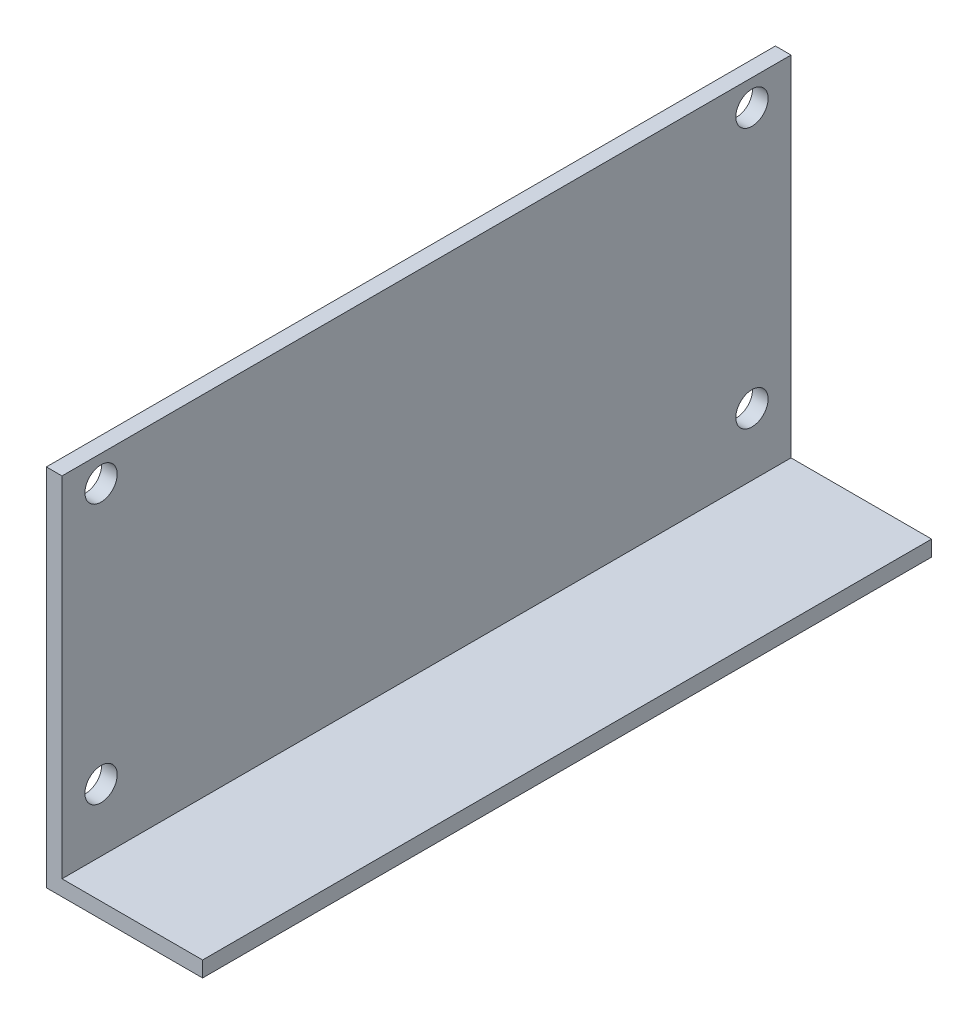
from build123d import *

# Parameters (mm, degrees)
BASE_EXTRUSION_DEPTH    = 70
ESQUISSE2_R             = 3.1
ENL_V_MAT_EXTRU_1_DEPTH = 3


with BuildPart() as part:
    # Esquisse1 → Base-Extrusion (new, symmetric)
    with BuildSketch(Plane.XY):
        Polygon((3, 70), (3, 3), (30, 3), (30, 0), (0, 0), (0, 70), align=None)
    extrude(amount=BASE_EXTRUSION_DEPTH, both=True)

    # Esquisse2 → Enl_v. mat.-Extru.1 (cut)
    with BuildSketch(Plane(origin=(3, 0, 0), x_dir=(0, 0, -1), z_dir=(1, 0, 0))):
        with Locations(Location((-62.5, 65, 0), (0, 0, 90))):
            Circle(ESQUISSE2_R)
        with Locations(Location((-62.5, 15, 0), (0, 0, 90))):
            Circle(ESQUISSE2_R)
        with Locations(Location((62.5, 65, 0), (0, 0, 90))):
            Circle(ESQUISSE2_R)
        with Locations(Location((62.5, 15, 0), (0, 0, 90))):
            Circle(ESQUISSE2_R)
    extrude(amount=-ENL_V_MAT_EXTRU_1_DEPTH, mode=Mode.SUBTRACT)


solid = part.part
